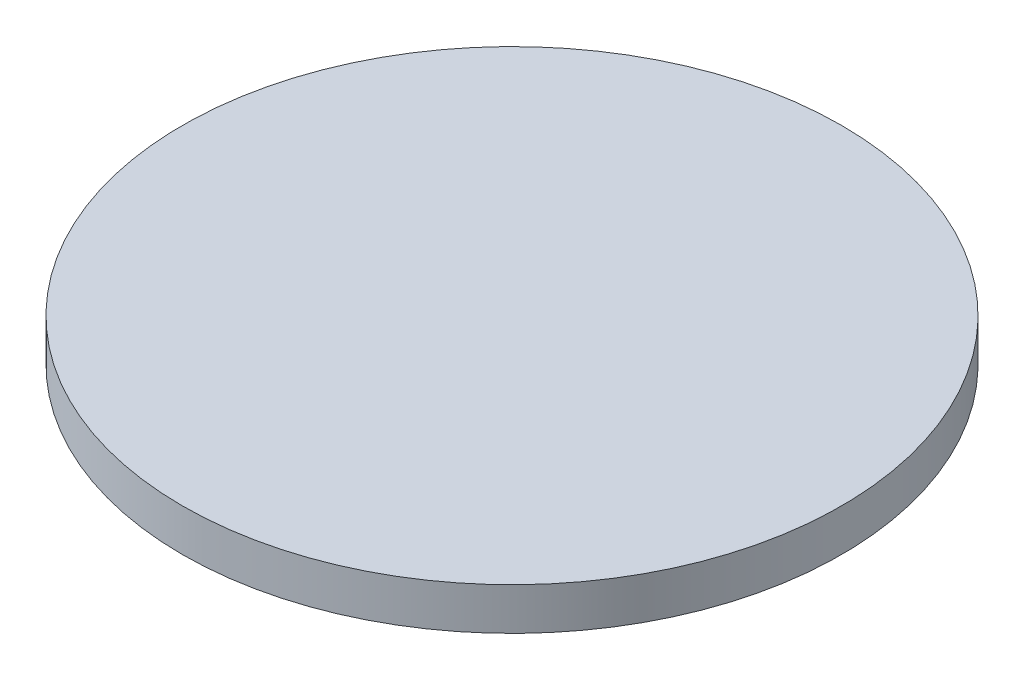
ISO-10303-21;
HEADER;
FILE_DESCRIPTION(('STEP AP214'),'2;1');
FILE_NAME('part.step','',(''),(''),'','','');
FILE_SCHEMA(('AUTOMOTIVE_DESIGN { 1 0 10303 214 1 1 1 1 }'));
ENDSEC;
DATA;
#1=APPLICATION_CONTEXT('core data for automotive mechanical design processes');
#2=APPLICATION_PROTOCOL_DEFINITION('international standard','automotive_design',2000,#1);
#3=PRODUCT_CONTEXT('',#1,'mechanical');
#4=PRODUCT('Part','Part','',(#3));
#5=PRODUCT_RELATED_PRODUCT_CATEGORY('part','',(#4));
#6=PRODUCT_DEFINITION_FORMATION('','',#4);
#7=PRODUCT_DEFINITION_CONTEXT('part definition',#1,'design');
#8=PRODUCT_DEFINITION('design','',#6,#7);
#9=PRODUCT_DEFINITION_SHAPE('','',#8);
#10=(LENGTH_UNIT() NAMED_UNIT(*) SI_UNIT(.MILLI.,.METRE.));
#11=(NAMED_UNIT(*) PLANE_ANGLE_UNIT() SI_UNIT($,.RADIAN.));
#12=(NAMED_UNIT(*) SI_UNIT($,.STERADIAN.) SOLID_ANGLE_UNIT());
#13=UNCERTAINTY_MEASURE_WITH_UNIT(LENGTH_MEASURE(1.E-05),#10,'distance_accuracy_value','');
#14=(GEOMETRIC_REPRESENTATION_CONTEXT(3) GLOBAL_UNCERTAINTY_ASSIGNED_CONTEXT((#13)) GLOBAL_UNIT_ASSIGNED_CONTEXT((#10,
#11,#12)) REPRESENTATION_CONTEXT('',''));
#15=CARTESIAN_POINT('',(0.,0.,0.));
#16=DIRECTION('',(0.,0.,1.));
#17=DIRECTION('',(1.,0.,0.));
#18=AXIS2_PLACEMENT_3D('',#15,#16,#17);
#19=CARTESIAN_POINT('',(0.,2.54,0.));
#20=DIRECTION('',(0.,-1.,0.));
#21=DIRECTION('',(0.,0.,-1.));
#22=AXIS2_PLACEMENT_3D('',#19,#20,#21);
#23=CYLINDRICAL_SURFACE('',#22,19.84375);
#24=CARTESIAN_POINT('',(0.,2.54,0.));
#25=DIRECTION('',(0.,1.,0.));
#26=DIRECTION('',(0.,0.,1.));
#27=AXIS2_PLACEMENT_3D('',#24,#25,#26);
#28=CIRCLE('',#27,19.84375);
#29=CARTESIAN_POINT('',(0.,2.54,19.84375));
#30=VERTEX_POINT('',#29);
#31=EDGE_CURVE('E10',#30,#30,#28,.T.);
#32=ORIENTED_EDGE('',*,*,#31,.F.);
#33=EDGE_LOOP('',(#32));
#34=FACE_BOUND('',#33,.T.);
#35=CARTESIAN_POINT('',(0.,0.,0.));
#36=DIRECTION('',(0.,1.,0.));
#37=DIRECTION('',(0.,0.,1.));
#38=AXIS2_PLACEMENT_3D('',#35,#36,#37);
#39=CIRCLE('',#38,19.84375);
#40=CARTESIAN_POINT('',(0.,0.,19.84375));
#41=VERTEX_POINT('',#40);
#42=EDGE_CURVE('E44',#41,#41,#39,.T.);
#43=ORIENTED_EDGE('',*,*,#42,.T.);
#44=EDGE_LOOP('',(#43));
#45=FACE_BOUND('',#44,.T.);
#46=ADVANCED_FACE('F41',(#34,#45),#23,.T.);
#47=CARTESIAN_POINT('',(0.,2.54,0.));
#48=DIRECTION('',(0.,1.,0.));
#49=DIRECTION('',(0.,0.,1.));
#50=AXIS2_PLACEMENT_3D('',#47,#48,#49);
#51=PLANE('',#50);
#52=ORIENTED_EDGE('',*,*,#31,.T.);
#53=EDGE_LOOP('',(#52));
#54=FACE_BOUND('',#53,.T.);
#55=ADVANCED_FACE('F58',(#54),#51,.T.);
#56=CARTESIAN_POINT('',(0.,0.,0.));
#57=DIRECTION('',(0.,1.,0.));
#58=DIRECTION('',(0.,0.,1.));
#59=AXIS2_PLACEMENT_3D('',#56,#57,#58);
#60=PLANE('',#59);
#61=ORIENTED_EDGE('',*,*,#42,.F.);
#62=EDGE_LOOP('',(#61));
#63=FACE_BOUND('',#62,.T.);
#64=ADVANCED_FACE('F56',(#63),#60,.F.);
#65=CLOSED_SHELL('',(#46,#55,#64));
#66=MANIFOLD_SOLID_BREP('B2',#65);
#67=ADVANCED_BREP_SHAPE_REPRESENTATION('',(#18,#66),#14);
#68=SHAPE_DEFINITION_REPRESENTATION(#9,#67);
ENDSEC;
END-ISO-10303-21;
